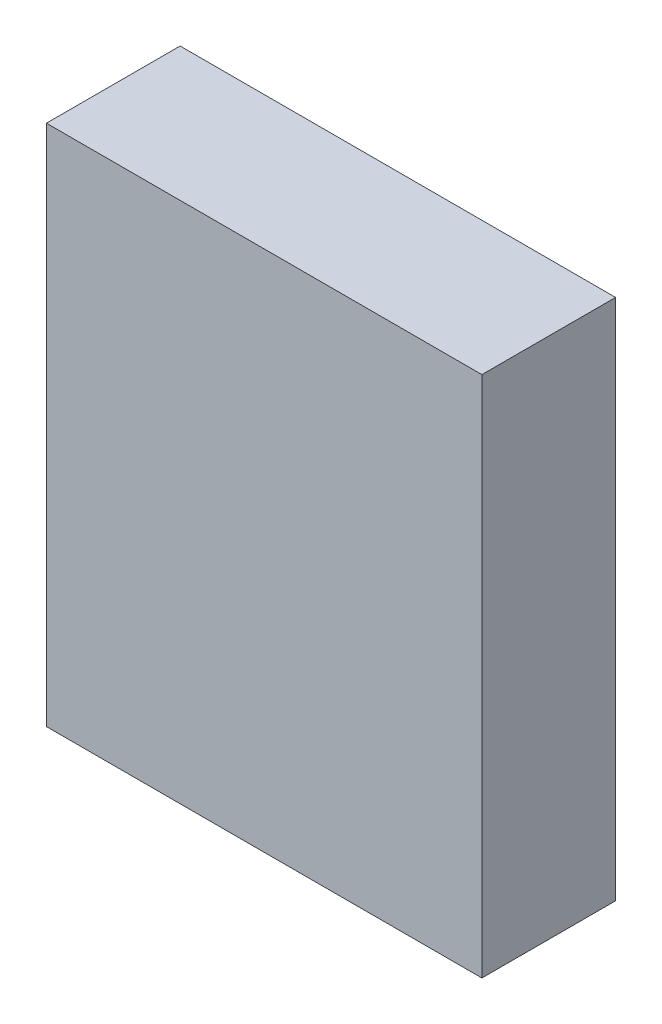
from build123d import *

# Parameters (mm, degrees)
SKETCH1_W            = 30.48
SKETCH1_H            = 7.7978
PANEL_OR_BLOCK_DEPTH = 25.4


with BuildPart() as part:
    # Sketch1 → Panel_or_block (new body)
    with BuildSketch(Plane.YZ):
        with Locations((0, -3.8989)):
            Rectangle(SKETCH1_W, SKETCH1_H)
    extrude(amount=PANEL_OR_BLOCK_DEPTH)


solid = part.part
